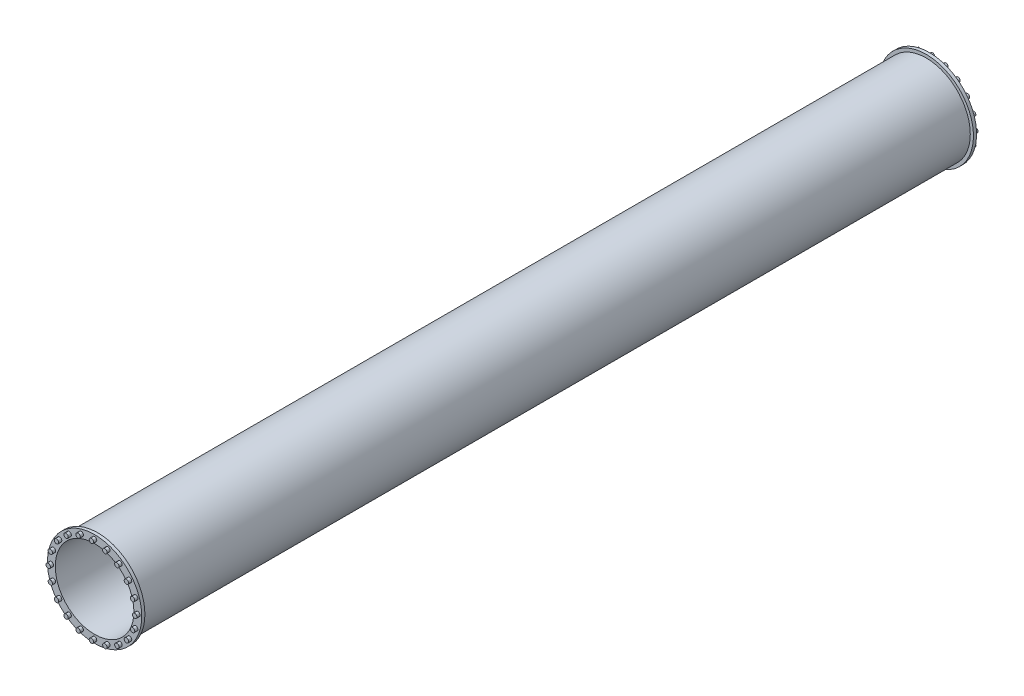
from build123d import *
from build123d.topology import SkipClean

# Parameters (mm, degrees)
SKETCH1_R           = 150
SKETCH1_R_2         = 125
BOSS_EXTRUDE1_DEPTH = 10
SKETCH2_R           = 7
BOSS_EXTRUDE2_DEPTH = 10
CIRPATTERN1_COUNT   = 20
BOSS_EXTRUDE3_START = 2635
SKETCH3_R           = 140
SKETCH3_R_2         = 125
BOSS_EXTRUDE3_DEPTH = 2635
BOSS_EXTRUDE4_START = 10
SKETCH4_R           = 150
SKETCH4_R_2         = 125
BOSS_EXTRUDE4_DEPTH = 10
BOSS_EXTRUDE5_START = 10
SKETCH5_R           = 7
BOSS_EXTRUDE5_DEPTH = 10
CIRPATTERN2_COUNT   = 20


with BuildPart() as part:
    # Sketch1 → Boss-Extrude1 (new body)
    with BuildSketch(Plane.XY):
        Circle(SKETCH1_R)
        Circle(SKETCH1_R_2, mode=Mode.SUBTRACT)
    extrude(amount=BOSS_EXTRUDE1_DEPTH)

    # Sketch2 → Boss-Extrude2 (add)
    with BuildSketch(Plane.XY.offset(10)):
        with Locations((0, 137.5)):
            Circle(SKETCH2_R)
    boss_extrude2 = extrude(amount=BOSS_EXTRUDE2_DEPTH)

    # CirPattern1: Boss-Extrude2 ×20 about axis
    cirpattern1_axis = Axis((0, 0, 0), (0, 0, 1))
    for i in range(1, CIRPATTERN1_COUNT):
        add(boss_extrude2.rotate(cirpattern1_axis, i * 360 / CIRPATTERN1_COUNT))

    # Sketch3 → Boss-Extrude3 (add)
    with SkipClean():  # the faces are left unmerged after this step: merging them gives an invalid solid
        with BuildSketch(Plane(origin=(0, 0, 0), x_dir=(-1, 0, 0), z_dir=(0, 0, -1)).offset(BOSS_EXTRUDE3_START)):
            with Locations(Location((0, 0, 0), (0, 0, 180))):
                Circle(SKETCH3_R)
            Circle(SKETCH3_R_2, mode=Mode.SUBTRACT)
        extrude(amount=-BOSS_EXTRUDE3_DEPTH)

    # Sketch4 → Boss-Extrude4 (add)
    with SkipClean():  # the faces are left unmerged after this step: merging them gives an invalid solid
        with BuildSketch(Plane(origin=(0, 0, -2635), x_dir=(-1, 0, 0), z_dir=(0, 0, -1)).offset(BOSS_EXTRUDE4_START)):
            with Locations(Location((0, 0, 0), (0, 0, 180))):
                Circle(SKETCH4_R)
            Circle(SKETCH4_R_2, mode=Mode.SUBTRACT)
        extrude(amount=-BOSS_EXTRUDE4_DEPTH)

    # Sketch5 → Boss-Extrude5 (add)
    with SkipClean():  # the faces are left unmerged after this step: merging them gives an invalid solid
        with BuildSketch(Plane(origin=(0, 0, -2645), x_dir=(-1, 0, 0), z_dir=(0, 0, -1)).offset(BOSS_EXTRUDE5_START)):
            with Locations(Location((0, 137.5, 0), (0, 0, 180))):
                Circle(SKETCH5_R)
        boss_extrude5 = extrude(amount=-BOSS_EXTRUDE5_DEPTH)

    # CirPattern2: Boss-Extrude5 ×20 about axis
    with SkipClean():  # the faces are left unmerged after this step: merging them gives an invalid solid
        cirpattern2_axis = Axis((0, 0, 0), (0, 0, 1))
        for i in range(1, CIRPATTERN2_COUNT):
            add(boss_extrude5.rotate(cirpattern2_axis, i * 360 / CIRPATTERN2_COUNT))


solid = part.part
